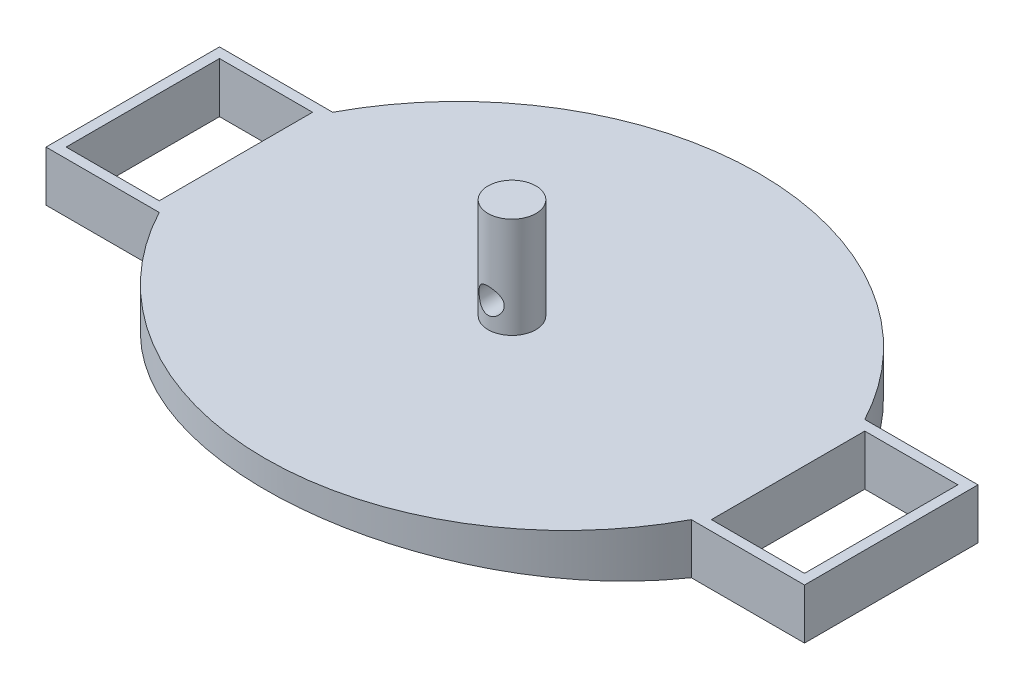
ISO-10303-21;
HEADER;
FILE_DESCRIPTION(('STEP AP214'),'2;1');
FILE_NAME('part.step','',(''),(''),'','','');
FILE_SCHEMA(('AUTOMOTIVE_DESIGN { 1 0 10303 214 1 1 1 1 }'));
ENDSEC;
DATA;
#1=APPLICATION_CONTEXT('core data for automotive mechanical design processes');
#2=APPLICATION_PROTOCOL_DEFINITION('international standard','automotive_design',2000,#1);
#3=PRODUCT_CONTEXT('',#1,'mechanical');
#4=PRODUCT('Part','Part','',(#3));
#5=PRODUCT_RELATED_PRODUCT_CATEGORY('part','',(#4));
#6=PRODUCT_DEFINITION_FORMATION('','',#4);
#7=PRODUCT_DEFINITION_CONTEXT('part definition',#1,'design');
#8=PRODUCT_DEFINITION('design','',#6,#7);
#9=PRODUCT_DEFINITION_SHAPE('','',#8);
#10=(LENGTH_UNIT() NAMED_UNIT(*) SI_UNIT(.MILLI.,.METRE.));
#11=(NAMED_UNIT(*) PLANE_ANGLE_UNIT() SI_UNIT($,.RADIAN.));
#12=(NAMED_UNIT(*) SI_UNIT($,.STERADIAN.) SOLID_ANGLE_UNIT());
#13=UNCERTAINTY_MEASURE_WITH_UNIT(LENGTH_MEASURE(1.E-05),#10,'distance_accuracy_value','');
#14=(GEOMETRIC_REPRESENTATION_CONTEXT(3) GLOBAL_UNCERTAINTY_ASSIGNED_CONTEXT((#13)) GLOBAL_UNIT_ASSIGNED_CONTEXT((#10,
#11,#12)) REPRESENTATION_CONTEXT('',''));
#15=CARTESIAN_POINT('',(0.,0.,0.));
#16=DIRECTION('',(0.,0.,1.));
#17=DIRECTION('',(1.,0.,0.));
#18=AXIS2_PLACEMENT_3D('',#15,#16,#17);
#19=CARTESIAN_POINT('',(0.,0.,55.6303340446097));
#20=DIRECTION('',(0.,-1.,0.));
#21=DIRECTION('',(0.,0.,-1.));
#22=AXIS2_PLACEMENT_3D('',#19,#20,#21);
#23=PLANE('',#22);
#24=DIRECTION('',(0.,0.,1.));
#25=VECTOR('',#24,1.);
#26=CARTESIAN_POINT('',(52.8406938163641,0.,-4.15939026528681));
#27=LINE('',#26,#25);
#28=CARTESIAN_POINT('',(52.8406938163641,0.,27.656191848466));
#29=VERTEX_POINT('',#28);
#30=CARTESIAN_POINT('',(52.8406938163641,0.,62.117160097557));
#31=VERTEX_POINT('',#30);
#32=EDGE_CURVE('E160',#29,#31,#27,.T.);
#33=ORIENTED_EDGE('',*,*,#32,.F.);
#34=DIRECTION('',(-1.,0.,0.));
#35=VECTOR('',#34,1.);
#36=CARTESIAN_POINT('',(52.8406938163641,0.,27.656191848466));
#37=LINE('',#36,#35);
#38=CARTESIAN_POINT('',(75.3294951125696,0.,27.656191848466));
#39=VERTEX_POINT('',#38);
#40=EDGE_CURVE('E203',#39,#29,#37,.T.);
#41=ORIENTED_EDGE('',*,*,#40,.F.);
#42=DIRECTION('',(0.,0.,-1.));
#43=VECTOR('',#42,1.);
#44=CARTESIAN_POINT('',(75.3294951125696,0.,62.1171600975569));
#45=LINE('',#44,#43);
#46=CARTESIAN_POINT('',(75.3294951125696,0.,62.1171600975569));
#47=VERTEX_POINT('',#46);
#48=EDGE_CURVE('E207',#47,#39,#45,.T.);
#49=ORIENTED_EDGE('',*,*,#48,.F.);
#50=DIRECTION('',(1.,0.,0.));
#51=VECTOR('',#50,1.);
#52=CARTESIAN_POINT('',(52.8406938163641,0.,62.1171600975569));
#53=LINE('',#52,#51);
#54=EDGE_CURVE('E209',#31,#47,#53,.T.);
#55=ORIENTED_EDGE('',*,*,#54,.F.);
#56=EDGE_LOOP('',(#33,#41,#49,#55));
#57=FACE_BOUND('',#56,.T.);
#58=DIRECTION('',(0.,0.,1.));
#59=VECTOR('',#58,1.);
#60=CARTESIAN_POINT('',(54.8406938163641,0.,60.1171600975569));
#61=LINE('',#60,#59);
#62=CARTESIAN_POINT('',(54.8406938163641,0.,29.656191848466));
#63=VERTEX_POINT('',#62);
#64=CARTESIAN_POINT('',(54.8406938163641,0.,60.1171600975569));
#65=VERTEX_POINT('',#64);
#66=EDGE_CURVE('E265',#63,#65,#61,.T.);
#67=ORIENTED_EDGE('',*,*,#66,.T.);
#68=DIRECTION('',(1.,0.,0.));
#69=VECTOR('',#68,1.);
#70=CARTESIAN_POINT('',(73.3294951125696,0.,60.1171600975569));
#71=LINE('',#70,#69);
#72=CARTESIAN_POINT('',(73.3294951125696,0.,60.1171600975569));
#73=VERTEX_POINT('',#72);
#74=EDGE_CURVE('E58',#65,#73,#71,.T.);
#75=ORIENTED_EDGE('',*,*,#74,.T.);
#76=DIRECTION('',(0.,0.,-1.));
#77=VECTOR('',#76,1.);
#78=CARTESIAN_POINT('',(73.3294951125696,0.,60.1171600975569));
#79=LINE('',#78,#77);
#80=CARTESIAN_POINT('',(73.3294951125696,0.,29.656191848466));
#81=VERTEX_POINT('',#80);
#82=EDGE_CURVE('E272',#73,#81,#79,.T.);
#83=ORIENTED_EDGE('',*,*,#82,.T.);
#84=DIRECTION('',(-1.,0.,0.));
#85=VECTOR('',#84,1.);
#86=CARTESIAN_POINT('',(73.3294951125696,0.,29.656191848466));
#87=LINE('',#86,#85);
#88=EDGE_CURVE('E269',#81,#63,#87,.T.);
#89=ORIENTED_EDGE('',*,*,#88,.T.);
#90=EDGE_LOOP('',(#67,#75,#83,#89));
#91=FACE_BOUND('',#90,.T.);
#92=ADVANCED_FACE('F35',(#57,#91),#23,.T.);
#93=CARTESIAN_POINT('',(0.,10.,55.6303340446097));
#94=DIRECTION('',(0.,-1.,0.));
#95=DIRECTION('',(0.,0.,-1.));
#96=AXIS2_PLACEMENT_3D('',#93,#94,#95);
#97=PLANE('',#96);
#98=CARTESIAN_POINT('',(0.,10.,44.8866759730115));
#99=DIRECTION('',(0.,-1.,0.));
#100=DIRECTION('',(0.,0.,-1.));
#101=AXIS2_PLACEMENT_3D('',#98,#99,#100);
#102=CIRCLE('',#101,4.75);
#103=CARTESIAN_POINT('',(0.,10.,40.1366759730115));
#104=VERTEX_POINT('',#103);
#105=EDGE_CURVE('E11',#104,#104,#102,.F.);
#106=ORIENTED_EDGE('',*,*,#105,.F.);
#107=EDGE_LOOP('',(#106));
#108=FACE_BOUND('',#107,.T.);
#109=DIRECTION('',(0.,0.,1.));
#110=VECTOR('',#109,1.);
#111=CARTESIAN_POINT('',(-73.3294951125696,10.,60.1171600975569));
#112=LINE('',#111,#110);
#113=CARTESIAN_POINT('',(-73.3294951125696,10.,29.656191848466));
#114=VERTEX_POINT('',#113);
#115=CARTESIAN_POINT('',(-73.3294951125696,10.,60.1171600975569));
#116=VERTEX_POINT('',#115);
#117=EDGE_CURVE('E240',#114,#116,#112,.T.);
#118=ORIENTED_EDGE('',*,*,#117,.F.);
#119=DIRECTION('',(-1.,0.,0.));
#120=VECTOR('',#119,1.);
#121=CARTESIAN_POINT('',(-73.3294951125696,10.,29.656191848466));
#122=LINE('',#121,#120);
#123=CARTESIAN_POINT('',(-54.8406938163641,10.,29.656191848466));
#124=VERTEX_POINT('',#123);
#125=EDGE_CURVE('E236',#124,#114,#122,.T.);
#126=ORIENTED_EDGE('',*,*,#125,.F.);
#127=DIRECTION('',(0.,0.,-1.));
#128=VECTOR('',#127,1.);
#129=CARTESIAN_POINT('',(-54.8406938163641,10.,60.1171600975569));
#130=LINE('',#129,#128);
#131=CARTESIAN_POINT('',(-54.8406938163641,10.,60.1171600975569));
#132=VERTEX_POINT('',#131);
#133=EDGE_CURVE('E252',#132,#124,#130,.T.);
#134=ORIENTED_EDGE('',*,*,#133,.F.);
#135=DIRECTION('',(1.,0.,0.));
#136=VECTOR('',#135,1.);
#137=CARTESIAN_POINT('',(-73.3294951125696,10.,60.1171600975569));
#138=LINE('',#137,#136);
#139=EDGE_CURVE('E255',#116,#132,#138,.T.);
#140=ORIENTED_EDGE('',*,*,#139,.F.);
#141=EDGE_LOOP('',(#118,#126,#134,#140));
#142=FACE_BOUND('',#141,.T.);
#143=CARTESIAN_POINT('',(0.,10.,55.6303340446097));
#144=DIRECTION('',(0.,1.,0.));
#145=DIRECTION('',(0.,0.,-1.));
#146=AXIS2_PLACEMENT_3D('',#143,#144,#145);
#147=CIRCLE('',#146,59.7887243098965);
#148=CARTESIAN_POINT('',(52.8406938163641,10.,27.656191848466));
#149=VERTEX_POINT('',#148);
#150=CARTESIAN_POINT('',(-52.8406938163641,10.,27.656191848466));
#151=VERTEX_POINT('',#150);
#152=EDGE_CURVE('E206',#149,#151,#147,.T.);
#153=ORIENTED_EDGE('',*,*,#152,.T.);
#154=DIRECTION('',(-1.,0.,0.));
#155=VECTOR('',#154,1.);
#156=CARTESIAN_POINT('',(-52.8406938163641,10.,27.656191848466));
#157=LINE('',#156,#155);
#158=CARTESIAN_POINT('',(-75.3294951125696,10.,27.656191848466));
#159=VERTEX_POINT('',#158);
#160=EDGE_CURVE('E181',#151,#159,#157,.T.);
#161=ORIENTED_EDGE('',*,*,#160,.T.);
#162=DIRECTION('',(0.,0.,1.));
#163=VECTOR('',#162,1.);
#164=CARTESIAN_POINT('',(-75.3294951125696,10.,62.1171600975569));
#165=LINE('',#164,#163);
#166=CARTESIAN_POINT('',(-75.3294951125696,10.,62.1171600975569));
#167=VERTEX_POINT('',#166);
#168=EDGE_CURVE('E223',#159,#167,#165,.T.);
#169=ORIENTED_EDGE('',*,*,#168,.T.);
#170=DIRECTION('',(1.,0.,0.));
#171=VECTOR('',#170,1.);
#172=CARTESIAN_POINT('',(-52.8406938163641,10.,62.1171600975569));
#173=LINE('',#172,#171);
#174=CARTESIAN_POINT('',(-52.8406938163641,10.,62.1171600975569));
#175=VERTEX_POINT('',#174);
#176=EDGE_CURVE('E221',#167,#175,#173,.T.);
#177=ORIENTED_EDGE('',*,*,#176,.T.);
#178=CARTESIAN_POINT('',(0.,10.,34.1430179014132));
#179=DIRECTION('',(0.,1.,0.));
#180=DIRECTION('',(0.,0.,1.));
#181=AXIS2_PLACEMENT_3D('',#178,#179,#180);
#182=CIRCLE('',#181,59.7887243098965);
#183=CARTESIAN_POINT('',(52.8406938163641,10.,62.117160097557));
#184=VERTEX_POINT('',#183);
#185=EDGE_CURVE('E219',#175,#184,#182,.T.);
#186=ORIENTED_EDGE('',*,*,#185,.T.);
#187=DIRECTION('',(1.,0.,0.));
#188=VECTOR('',#187,1.);
#189=CARTESIAN_POINT('',(52.8406938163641,10.,62.1171600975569));
#190=LINE('',#189,#188);
#191=CARTESIAN_POINT('',(75.3294951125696,10.,62.1171600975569));
#192=VERTEX_POINT('',#191);
#193=EDGE_CURVE('E217',#184,#192,#190,.T.);
#194=ORIENTED_EDGE('',*,*,#193,.T.);
#195=DIRECTION('',(0.,0.,-1.));
#196=VECTOR('',#195,1.);
#197=CARTESIAN_POINT('',(75.3294951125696,10.,62.1171600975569));
#198=LINE('',#197,#196);
#199=CARTESIAN_POINT('',(75.3294951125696,10.,27.656191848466));
#200=VERTEX_POINT('',#199);
#201=EDGE_CURVE('E215',#192,#200,#198,.T.);
#202=ORIENTED_EDGE('',*,*,#201,.T.);
#203=DIRECTION('',(-1.,0.,0.));
#204=VECTOR('',#203,1.);
#205=CARTESIAN_POINT('',(52.8406938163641,10.,27.656191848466));
#206=LINE('',#205,#204);
#207=EDGE_CURVE('E202',#200,#149,#206,.T.);
#208=ORIENTED_EDGE('',*,*,#207,.T.);
#209=EDGE_LOOP('',(#153,#161,#169,#177,#186,#194,#202,#208));
#210=FACE_BOUND('',#209,.T.);
#211=DIRECTION('',(1.,0.,0.));
#212=VECTOR('',#211,1.);
#213=CARTESIAN_POINT('',(73.3294951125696,10.,60.1171600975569));
#214=LINE('',#213,#212);
#215=CARTESIAN_POINT('',(54.8406938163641,10.,60.1171600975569));
#216=VERTEX_POINT('',#215);
#217=CARTESIAN_POINT('',(73.3294951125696,10.,60.1171600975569));
#218=VERTEX_POINT('',#217);
#219=EDGE_CURVE('E268',#216,#218,#214,.T.);
#220=ORIENTED_EDGE('',*,*,#219,.F.);
#221=DIRECTION('',(0.,0.,1.));
#222=VECTOR('',#221,1.);
#223=CARTESIAN_POINT('',(54.8406938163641,10.,60.1171600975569));
#224=LINE('',#223,#222);
#225=CARTESIAN_POINT('',(54.8406938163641,10.,29.656191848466));
#226=VERTEX_POINT('',#225);
#227=EDGE_CURVE('E264',#226,#216,#224,.T.);
#228=ORIENTED_EDGE('',*,*,#227,.F.);
#229=DIRECTION('',(-1.,0.,0.));
#230=VECTOR('',#229,1.);
#231=CARTESIAN_POINT('',(73.3294951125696,10.,29.656191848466));
#232=LINE('',#231,#230);
#233=CARTESIAN_POINT('',(73.3294951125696,10.,29.656191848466));
#234=VERTEX_POINT('',#233);
#235=EDGE_CURVE('E278',#234,#226,#232,.T.);
#236=ORIENTED_EDGE('',*,*,#235,.F.);
#237=DIRECTION('',(0.,0.,-1.));
#238=VECTOR('',#237,1.);
#239=CARTESIAN_POINT('',(73.3294951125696,10.,60.1171600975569));
#240=LINE('',#239,#238);
#241=EDGE_CURVE('E280',#218,#234,#240,.T.);
#242=ORIENTED_EDGE('',*,*,#241,.F.);
#243=EDGE_LOOP('',(#220,#228,#236,#242));
#244=FACE_BOUND('',#243,.T.);
#245=ADVANCED_FACE('F336',(#108,#142,#210,#244),#97,.F.);
#246=DIRECTION('',(0.,0.,1.));
#247=VECTOR('',#246,1.);
#248=CARTESIAN_POINT('',(-52.8406938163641,0.,-4.15939026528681));
#249=LINE('',#248,#247);
#250=CARTESIAN_POINT('',(-52.8406938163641,0.,27.656191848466));
#251=VERTEX_POINT('',#250);
#252=CARTESIAN_POINT('',(-52.8406938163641,0.,62.1171600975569));
#253=VERTEX_POINT('',#252);
#254=EDGE_CURVE('E149',#251,#253,#249,.T.);
#255=ORIENTED_EDGE('',*,*,#254,.T.);
#256=DIRECTION('',(1.,0.,0.));
#257=VECTOR('',#256,1.);
#258=CARTESIAN_POINT('',(-52.8406938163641,0.,62.1171600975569));
#259=LINE('',#258,#257);
#260=CARTESIAN_POINT('',(-75.3294951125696,0.,62.1171600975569));
#261=VERTEX_POINT('',#260);
#262=EDGE_CURVE('E211',#261,#253,#259,.T.);
#263=ORIENTED_EDGE('',*,*,#262,.F.);
#264=DIRECTION('',(0.,0.,1.));
#265=VECTOR('',#264,1.);
#266=CARTESIAN_POINT('',(-75.3294951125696,0.,62.1171600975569));
#267=LINE('',#266,#265);
#268=CARTESIAN_POINT('',(-75.3294951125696,0.,27.656191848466));
#269=VERTEX_POINT('',#268);
#270=EDGE_CURVE('E174',#269,#261,#267,.T.);
#271=ORIENTED_EDGE('',*,*,#270,.F.);
#272=DIRECTION('',(-1.,0.,0.));
#273=VECTOR('',#272,1.);
#274=CARTESIAN_POINT('',(-52.8406938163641,0.,27.656191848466));
#275=LINE('',#274,#273);
#276=EDGE_CURVE('E171',#251,#269,#275,.T.);
#277=ORIENTED_EDGE('',*,*,#276,.F.);
#278=EDGE_LOOP('',(#255,#263,#271,#277));
#279=FACE_BOUND('',#278,.T.);
#280=DIRECTION('',(-1.,0.,0.));
#281=VECTOR('',#280,1.);
#282=CARTESIAN_POINT('',(-73.3294951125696,0.,29.656191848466));
#283=LINE('',#282,#281);
#284=CARTESIAN_POINT('',(-54.8406938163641,0.,29.656191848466));
#285=VERTEX_POINT('',#284);
#286=CARTESIAN_POINT('',(-73.3294951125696,0.,29.656191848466));
#287=VERTEX_POINT('',#286);
#288=EDGE_CURVE('E237',#285,#287,#283,.T.);
#289=ORIENTED_EDGE('',*,*,#288,.T.);
#290=DIRECTION('',(0.,0.,1.));
#291=VECTOR('',#290,1.);
#292=CARTESIAN_POINT('',(-73.3294951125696,0.,60.1171600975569));
#293=LINE('',#292,#291);
#294=CARTESIAN_POINT('',(-73.3294951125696,0.,60.1171600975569));
#295=VERTEX_POINT('',#294);
#296=EDGE_CURVE('E247',#287,#295,#293,.T.);
#297=ORIENTED_EDGE('',*,*,#296,.T.);
#298=DIRECTION('',(1.,0.,0.));
#299=VECTOR('',#298,1.);
#300=CARTESIAN_POINT('',(-73.3294951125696,0.,60.1171600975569));
#301=LINE('',#300,#299);
#302=CARTESIAN_POINT('',(-54.8406938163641,0.,60.1171600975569));
#303=VERTEX_POINT('',#302);
#304=EDGE_CURVE('E244',#295,#303,#301,.T.);
#305=ORIENTED_EDGE('',*,*,#304,.T.);
#306=DIRECTION('',(0.,0.,-1.));
#307=VECTOR('',#306,1.);
#308=CARTESIAN_POINT('',(-54.8406938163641,0.,60.1171600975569));
#309=LINE('',#308,#307);
#310=EDGE_CURVE('E241',#303,#285,#309,.T.);
#311=ORIENTED_EDGE('',*,*,#310,.T.);
#312=EDGE_LOOP('',(#289,#297,#305,#311));
#313=FACE_BOUND('',#312,.T.);
#314=ADVANCED_FACE('F172',(#279,#313),#23,.T.);
#315=CARTESIAN_POINT('',(0.,10.,55.6303340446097));
#316=DIRECTION('',(0.,-1.,0.));
#317=DIRECTION('',(0.,0.,-1.));
#318=AXIS2_PLACEMENT_3D('',#315,#316,#317);
#319=CYLINDRICAL_SURFACE('',#318,59.7887243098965);
#320=DIRECTION('',(0.,-1.,0.));
#321=VECTOR('',#320,1.);
#322=CARTESIAN_POINT('',(52.8406938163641,10.,27.656191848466));
#323=LINE('',#322,#321);
#324=EDGE_CURVE('E168',#149,#29,#323,.T.);
#325=ORIENTED_EDGE('',*,*,#324,.T.);
#326=CARTESIAN_POINT('',(-52.8406938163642,0.,27.6561918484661));
#327=CARTESIAN_POINT('',(-52.4455885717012,0.0699177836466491,26.9098531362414));
#328=CARTESIAN_POINT('',(-52.034737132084,0.141818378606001,26.1720492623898));
#329=CARTESIAN_POINT('',(-51.1823306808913,0.289043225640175,24.7147575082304));
#330=CARTESIAN_POINT('',(-50.7407760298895,0.364367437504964,23.9952694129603));
#331=CARTESIAN_POINT('',(-49.827780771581,0.517892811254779,22.575897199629));
#332=CARTESIAN_POINT('',(-49.3563426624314,0.596093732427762,21.8760114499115));
#333=CARTESIAN_POINT('',(-48.3844432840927,0.754805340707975,20.4970308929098));
#334=CARTESIAN_POINT('',(-47.8839819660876,0.83531603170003,19.8179361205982));
#335=CARTESIAN_POINT('',(-46.3407668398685,1.07938563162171,17.814129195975));
#336=CARTESIAN_POINT('',(-45.2556010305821,1.24558082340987,16.5219918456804));
#337=CARTESIAN_POINT('',(-42.9803057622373,1.58017959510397,14.034333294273));
#338=CARTESIAN_POINT('',(-41.7901760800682,1.74858317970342,12.8388122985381));
#339=CARTESIAN_POINT('',(-39.3125237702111,2.08292472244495,10.5519616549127));
#340=CARTESIAN_POINT('',(-38.0249675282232,2.24886180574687,9.46066826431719));
#341=CARTESIAN_POINT('',(-35.361654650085,2.5735278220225,7.39041395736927));
#342=CARTESIAN_POINT('',(-33.98589756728,2.73225671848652,6.41145360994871));
#343=CARTESIAN_POINT('',(-31.1559408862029,3.03799620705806,4.5730602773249));
#344=CARTESIAN_POINT('',(-29.7017604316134,3.18500963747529,3.7135983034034));
#345=CARTESIAN_POINT('',(-26.7247151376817,3.46320530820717,2.12022750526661));
#346=CARTESIAN_POINT('',(-25.2018508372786,3.59438767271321,1.38631769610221));
#347=CARTESIAN_POINT('',(-22.1024173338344,3.83686008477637,0.0514363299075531));
#348=CARTESIAN_POINT('',(-20.5260085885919,3.94820423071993,-0.549897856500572));
#349=CARTESIAN_POINT('',(-17.3266986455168,4.14828007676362,-1.61755567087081));
#350=CARTESIAN_POINT('',(-15.7037974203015,4.23701176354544,-2.08387921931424));
#351=CARTESIAN_POINT('',(-12.4231704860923,4.38932673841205,-2.87782530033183));
#352=CARTESIAN_POINT('',(-10.7654432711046,4.45290893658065,-3.20544182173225));
#353=CARTESIAN_POINT('',(-7.42741761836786,4.55308824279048,-3.71927848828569));
#354=CARTESIAN_POINT('',(-5.74711950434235,4.58968573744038,-3.90550065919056));
#355=CARTESIAN_POINT('',(-2.40514191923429,4.6344561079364,-4.13306710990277));
#356=CARTESIAN_POINT('',(-0.743632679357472,4.64310243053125,-4.17682459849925));
#357=CARTESIAN_POINT('',(2.57716793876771,4.63306216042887,-4.12589789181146));
#358=CARTESIAN_POINT('',(4.23645934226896,4.61437588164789,-4.03121528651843));
#359=CARTESIAN_POINT('',(7.54069151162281,4.55019690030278,-3.7041877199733));
#360=CARTESIAN_POINT('',(9.18563393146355,4.50470732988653,-3.47185884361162));
#361=CARTESIAN_POINT('',(12.4496131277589,4.3881927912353,-2.87139435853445));
#362=CARTESIAN_POINT('',(14.0686499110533,4.31716782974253,-2.50325878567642));
#363=CARTESIAN_POINT('',(17.2607271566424,4.15200242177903,-1.63640427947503));
#364=CARTESIAN_POINT('',(18.8339689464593,4.05798900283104,-1.13840197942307));
#365=CARTESIAN_POINT('',(21.9327104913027,3.84921885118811,-0.0146482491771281));
#366=CARTESIAN_POINT('',(23.4582102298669,3.73446211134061,0.611103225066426));
#367=CARTESIAN_POINT('',(26.4516365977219,3.48727794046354,1.98598583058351));
#368=CARTESIAN_POINT('',(27.919544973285,3.35484496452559,2.73515569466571));
#369=CARTESIAN_POINT('',(30.7875099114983,3.07591005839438,4.35138928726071));
#370=CARTESIAN_POINT('',(32.1875671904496,2.92940827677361,5.21845177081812));
#371=CARTESIAN_POINT('',(34.9307447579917,2.62403263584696,7.0780864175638));
#372=CARTESIAN_POINT('',(36.2727228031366,2.46500834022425,8.07231899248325));
#373=CARTESIAN_POINT('',(38.8685484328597,2.14088742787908,10.1692350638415));
#374=CARTESIAN_POINT('',(40.1223865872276,1.97579016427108,11.2719301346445));
#375=CARTESIAN_POINT('',(42.5322268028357,1.64425723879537,13.5770425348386));
#376=CARTESIAN_POINT('',(43.6883188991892,1.47782296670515,14.7793660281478));
#377=CARTESIAN_POINT('',(45.8959487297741,1.14810248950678,17.276345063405));
#378=CARTESIAN_POINT('',(46.9475260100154,0.98481511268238,18.5709653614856));
#379=CARTESIAN_POINT('',(48.4002956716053,0.752195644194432,20.5206648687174));
#380=CARTESIAN_POINT('',(48.8456364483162,0.679813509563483,21.1429294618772));
#381=CARTESIAN_POINT('',(49.7121405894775,0.537098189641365,22.4041446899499));
#382=CARTESIAN_POINT('',(50.1333095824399,0.466764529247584,23.0430913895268));
#383=CARTESIAN_POINT('',(50.9501963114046,0.328675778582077,24.3357243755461));
#384=CARTESIAN_POINT('',(51.345957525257,0.260916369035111,24.9893827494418));
#385=CARTESIAN_POINT('',(52.1123492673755,0.128229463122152,26.31175753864));
#386=CARTESIAN_POINT('',(52.4829738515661,0.0633026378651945,26.9804774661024));
#387=CARTESIAN_POINT('',(52.8406938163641,0.,27.656191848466));
#388=B_SPLINE_CURVE_WITH_KNOTS('',3,(#326,#327,#328,#329,#330,#331,#332,#333,#334,#335,#336,
#337,#338,#339,#340,#341,#342,#343,#344,#345,#346,#347,#348,#349,#350,#351,#352,#353,#354,#355,
#356,#357,#358,#359,#360,#361,#362,#363,#364,#365,#366,#367,#368,#369,#370,#371,#372,#373,#374,
#375,#376,#377,#378,#379,#380,#381,#382,#383,#384,#385,#386,#387),.UNSPECIFIED.,.F.,.F.,(4,2,2,
2,2,2,2,2,2,2,2,2,2,2,2,2,2,2,2,2,2,2,2,2,2,2,2,2,2,2,4),(0.,2.54186674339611,5.08370364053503,
7.6253283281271,10.1669572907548,15.2469919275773,20.3270373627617,25.4088435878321,
30.4906755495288,35.571272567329,40.651829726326,45.7183128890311,50.784799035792,
55.8515047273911,60.918137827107,65.8984881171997,70.8787812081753,75.8584924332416,
80.8382023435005,85.7909941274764,90.7437876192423,95.6981384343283,100.65243693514,
105.679701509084,110.707503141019,115.730621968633,120.751832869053,123.057257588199,
125.362143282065,127.662973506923,129.964345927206),.UNSPECIFIED.);
#389=EDGE_CURVE('E152',#251,#29,#388,.T.);
#390=ORIENTED_EDGE('',*,*,#389,.F.);
#391=DIRECTION('',(0.,-1.,0.));
#392=VECTOR('',#391,1.);
#393=CARTESIAN_POINT('',(-52.8406938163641,10.,27.656191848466));
#394=LINE('',#393,#392);
#395=EDGE_CURVE('E43',#151,#251,#394,.T.);
#396=ORIENTED_EDGE('',*,*,#395,.F.);
#397=ORIENTED_EDGE('',*,*,#152,.F.);
#398=EDGE_LOOP('',(#325,#390,#396,#397));
#399=FACE_BOUND('',#398,.T.);
#400=ADVANCED_FACE('F37',(#399),#319,.T.);
#401=CARTESIAN_POINT('',(-52.8406938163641,10.,27.656191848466));
#402=DIRECTION('',(0.,0.,1.));
#403=DIRECTION('',(1.,0.,0.));
#404=AXIS2_PLACEMENT_3D('',#401,#402,#403);
#405=PLANE('',#404);
#406=ORIENTED_EDGE('',*,*,#276,.T.);
#407=DIRECTION('',(0.,-1.,0.));
#408=VECTOR('',#407,1.);
#409=CARTESIAN_POINT('',(-75.3294951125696,10.,27.656191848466));
#410=LINE('',#409,#408);
#411=EDGE_CURVE('E183',#159,#269,#410,.T.);
#412=ORIENTED_EDGE('',*,*,#411,.F.);
#413=ORIENTED_EDGE('',*,*,#160,.F.);
#414=ORIENTED_EDGE('',*,*,#395,.T.);
#415=EDGE_LOOP('',(#406,#412,#413,#414));
#416=FACE_BOUND('',#415,.T.);
#417=ADVANCED_FACE('F180',(#416),#405,.F.);
#418=CARTESIAN_POINT('',(-75.3294951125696,10.,62.1171600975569));
#419=DIRECTION('',(1.,0.,0.));
#420=DIRECTION('',(0.,0.,-1.));
#421=AXIS2_PLACEMENT_3D('',#418,#419,#420);
#422=PLANE('',#421);
#423=ORIENTED_EDGE('',*,*,#270,.T.);
#424=DIRECTION('',(0.,-1.,0.));
#425=VECTOR('',#424,1.);
#426=CARTESIAN_POINT('',(-75.3294951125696,10.,62.1171600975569));
#427=LINE('',#426,#425);
#428=EDGE_CURVE('E184',#167,#261,#427,.T.);
#429=ORIENTED_EDGE('',*,*,#428,.F.);
#430=ORIENTED_EDGE('',*,*,#168,.F.);
#431=ORIENTED_EDGE('',*,*,#411,.T.);
#432=EDGE_LOOP('',(#423,#429,#430,#431));
#433=FACE_BOUND('',#432,.T.);
#434=ADVANCED_FACE('F377',(#433),#422,.F.);
#435=CARTESIAN_POINT('',(-52.8406938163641,10.,62.1171600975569));
#436=DIRECTION('',(0.,0.,-1.));
#437=DIRECTION('',(-1.,0.,0.));
#438=AXIS2_PLACEMENT_3D('',#435,#436,#437);
#439=PLANE('',#438);
#440=ORIENTED_EDGE('',*,*,#262,.T.);
#441=DIRECTION('',(0.,-1.,0.));
#442=VECTOR('',#441,1.);
#443=CARTESIAN_POINT('',(-52.8406938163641,10.,62.1171600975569));
#444=LINE('',#443,#442);
#445=EDGE_CURVE('E189',#175,#253,#444,.T.);
#446=ORIENTED_EDGE('',*,*,#445,.F.);
#447=ORIENTED_EDGE('',*,*,#176,.F.);
#448=ORIENTED_EDGE('',*,*,#428,.T.);
#449=EDGE_LOOP('',(#440,#446,#447,#448));
#450=FACE_BOUND('',#449,.T.);
#451=ADVANCED_FACE('F381',(#450),#439,.F.);
#452=CARTESIAN_POINT('',(0.,10.,34.1430179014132));
#453=DIRECTION('',(0.,-1.,0.));
#454=DIRECTION('',(0.,0.,-1.));
#455=AXIS2_PLACEMENT_3D('',#452,#453,#454);
#456=CYLINDRICAL_SURFACE('',#455,59.7887243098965);
#457=ORIENTED_EDGE('',*,*,#445,.T.);
#458=CARTESIAN_POINT('',(52.8406938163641,0.,62.117160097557));
#459=CARTESIAN_POINT('',(52.4455885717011,0.0699177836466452,62.8634988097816));
#460=CARTESIAN_POINT('',(52.034737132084,0.141818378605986,63.6013026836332));
#461=CARTESIAN_POINT('',(51.1823306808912,0.289043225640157,65.0585944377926));
#462=CARTESIAN_POINT('',(50.7407760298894,0.364367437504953,65.7780825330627));
#463=CARTESIAN_POINT('',(49.8277807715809,0.517892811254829,67.197454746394));
#464=CARTESIAN_POINT('',(49.3563426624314,0.596093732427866,67.8973404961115));
#465=CARTESIAN_POINT('',(48.3844432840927,0.754805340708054,69.2763210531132));
#466=CARTESIAN_POINT('',(47.8839819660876,0.835316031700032,69.9554158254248));
#467=CARTESIAN_POINT('',(46.3407668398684,1.07938563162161,71.959222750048));
#468=CARTESIAN_POINT('',(45.255601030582,1.24558082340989,73.2513601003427));
#469=CARTESIAN_POINT('',(42.9803057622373,1.58017959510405,75.7390186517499));
#470=CARTESIAN_POINT('',(41.7901760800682,1.74858317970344,76.9345396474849));
#471=CARTESIAN_POINT('',(39.312523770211,2.08292472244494,79.2213902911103));
#472=CARTESIAN_POINT('',(38.0249675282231,2.24886180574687,80.3126836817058));
#473=CARTESIAN_POINT('',(35.3616546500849,2.57352782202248,82.3829379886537));
#474=CARTESIAN_POINT('',(33.9858975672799,2.73225671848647,83.3618983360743));
#475=CARTESIAN_POINT('',(31.1559408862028,3.03799620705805,85.2002916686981));
#476=CARTESIAN_POINT('',(29.7017604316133,3.18500963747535,86.0597536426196));
#477=CARTESIAN_POINT('',(26.7247151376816,3.46320530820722,87.6531244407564));
#478=CARTESIAN_POINT('',(25.2018508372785,3.59438767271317,88.3870342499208));
#479=CARTESIAN_POINT('',(22.1024173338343,3.83686008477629,89.7219156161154));
#480=CARTESIAN_POINT('',(20.5260085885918,3.9482042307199,90.3232498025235));
#481=CARTESIAN_POINT('',(17.3266986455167,4.14828007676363,91.3909076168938));
#482=CARTESIAN_POINT('',(15.7037974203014,4.23701176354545,91.8572311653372));
#483=CARTESIAN_POINT('',(12.4231704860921,4.38932673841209,92.6511772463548));
#484=CARTESIAN_POINT('',(10.7654432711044,4.45290893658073,92.9787937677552));
#485=CARTESIAN_POINT('',(7.42741761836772,4.55308824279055,93.4926304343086));
#486=CARTESIAN_POINT('',(5.74711950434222,4.5896857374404,93.6788526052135));
#487=CARTESIAN_POINT('',(2.40514191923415,4.63445610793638,93.9064190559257));
#488=CARTESIAN_POINT('',(0.743632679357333,4.64310243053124,93.9501765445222));
#489=CARTESIAN_POINT('',(-2.57716793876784,4.63306216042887,93.8992498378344));
#490=CARTESIAN_POINT('',(-4.23645934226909,4.6143758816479,93.8045672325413));
#491=CARTESIAN_POINT('',(-7.54069151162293,4.55019690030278,93.4775396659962));
#492=CARTESIAN_POINT('',(-9.18563393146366,4.50470732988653,93.2452107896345));
#493=CARTESIAN_POINT('',(-12.449613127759,4.3881927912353,92.6447463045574));
#494=CARTESIAN_POINT('',(-14.0686499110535,4.31716782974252,92.2766107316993));
#495=CARTESIAN_POINT('',(-17.2607271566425,4.15200242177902,91.4097562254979));
#496=CARTESIAN_POINT('',(-18.8339689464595,4.05798900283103,90.911753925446));
#497=CARTESIAN_POINT('',(-21.9327104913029,3.84921885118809,89.7880001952));
#498=CARTESIAN_POINT('',(-23.458210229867,3.73446211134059,89.1622487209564));
#499=CARTESIAN_POINT('',(-26.451636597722,3.48727794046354,87.7873661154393));
#500=CARTESIAN_POINT('',(-27.9195449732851,3.35484496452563,87.0381962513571));
#501=CARTESIAN_POINT('',(-30.7875099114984,3.07591005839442,85.4219626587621));
#502=CARTESIAN_POINT('',(-32.1875671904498,2.92940827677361,84.5549001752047));
#503=CARTESIAN_POINT('',(-34.9307447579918,2.62403263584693,82.695265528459));
#504=CARTESIAN_POINT('',(-36.2727228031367,2.46500834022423,81.7010329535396));
#505=CARTESIAN_POINT('',(-38.8685484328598,2.14088742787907,79.6041168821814));
#506=CARTESIAN_POINT('',(-40.1223865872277,1.97579016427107,78.5014218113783));
#507=CARTESIAN_POINT('',(-42.5322268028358,1.64425723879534,76.1963094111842));
#508=CARTESIAN_POINT('',(-43.6883188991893,1.47782296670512,74.993985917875));
#509=CARTESIAN_POINT('',(-45.8959487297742,1.14810248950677,72.4970068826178));
#510=CARTESIAN_POINT('',(-46.9475260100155,0.984815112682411,71.2023865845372));
#511=CARTESIAN_POINT('',(-48.4002956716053,0.752195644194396,69.2526870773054));
#512=CARTESIAN_POINT('',(-48.8456364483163,0.679813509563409,68.6304224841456));
#513=CARTESIAN_POINT('',(-49.7121405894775,0.5370981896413,67.3692072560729));
#514=CARTESIAN_POINT('',(-50.1333095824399,0.466764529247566,66.7302605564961));
#515=CARTESIAN_POINT('',(-50.9501963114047,0.328675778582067,65.4376275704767));
#516=CARTESIAN_POINT('',(-51.345957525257,0.260916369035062,64.783969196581));
#517=CARTESIAN_POINT('',(-52.1123492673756,0.128229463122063,63.4615944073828));
#518=CARTESIAN_POINT('',(-52.4829738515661,0.0633026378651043,62.7928744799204));
#519=CARTESIAN_POINT('',(-52.8406938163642,0.,62.1171600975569));
#520=B_SPLINE_CURVE_WITH_KNOTS('',3,(#458,#459,#460,#461,#462,#463,#464,#465,#466,#467,#468,
#469,#470,#471,#472,#473,#474,#475,#476,#477,#478,#479,#480,#481,#482,#483,#484,#485,#486,#487,
#488,#489,#490,#491,#492,#493,#494,#495,#496,#497,#498,#499,#500,#501,#502,#503,#504,#505,#506,
#507,#508,#509,#510,#511,#512,#513,#514,#515,#516,#517,#518,#519),.UNSPECIFIED.,.F.,.F.,(4,2,2,
2,2,2,2,2,2,2,2,2,2,2,2,2,2,2,2,2,2,2,2,2,2,2,2,2,2,2,4),(0.,2.5418667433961,5.08370364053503,
7.6253283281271,10.1669572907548,15.2469919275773,20.3270373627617,25.4088435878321,
30.4906755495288,35.571272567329,40.651829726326,45.7183128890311,50.784799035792,
55.8515047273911,60.9181378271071,65.8984881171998,70.8787812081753,75.8584924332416,
80.8382023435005,85.7909941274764,90.7437876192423,95.6981384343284,100.65243693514,
105.679701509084,110.707503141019,115.730621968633,120.751832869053,123.057257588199,
125.362143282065,127.662973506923,129.964345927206),.UNSPECIFIED.);
#521=EDGE_CURVE('E155',#31,#253,#520,.T.);
#522=ORIENTED_EDGE('',*,*,#521,.F.);
#523=DIRECTION('',(0.,-1.,0.));
#524=VECTOR('',#523,1.);
#525=CARTESIAN_POINT('',(52.8406938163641,10.,62.117160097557));
#526=LINE('',#525,#524);
#527=EDGE_CURVE('E192',#184,#31,#526,.T.);
#528=ORIENTED_EDGE('',*,*,#527,.F.);
#529=ORIENTED_EDGE('',*,*,#185,.F.);
#530=EDGE_LOOP('',(#457,#522,#528,#529));
#531=FACE_BOUND('',#530,.T.);
#532=ADVANCED_FACE('F387',(#531),#456,.T.);
#533=CARTESIAN_POINT('',(52.8406938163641,10.,62.1171600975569));
#534=DIRECTION('',(0.,0.,-1.));
#535=DIRECTION('',(-1.,0.,0.));
#536=AXIS2_PLACEMENT_3D('',#533,#534,#535);
#537=PLANE('',#536);
#538=ORIENTED_EDGE('',*,*,#54,.T.);
#539=DIRECTION('',(0.,-1.,0.));
#540=VECTOR('',#539,1.);
#541=CARTESIAN_POINT('',(75.3294951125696,10.,62.1171600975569));
#542=LINE('',#541,#540);
#543=EDGE_CURVE('E195',#192,#47,#542,.T.);
#544=ORIENTED_EDGE('',*,*,#543,.F.);
#545=ORIENTED_EDGE('',*,*,#193,.F.);
#546=ORIENTED_EDGE('',*,*,#527,.T.);
#547=EDGE_LOOP('',(#538,#544,#545,#546));
#548=FACE_BOUND('',#547,.T.);
#549=ADVANCED_FACE('F391',(#548),#537,.F.);
#550=CARTESIAN_POINT('',(75.3294951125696,10.,62.1171600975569));
#551=DIRECTION('',(-1.,0.,0.));
#552=DIRECTION('',(0.,0.,1.));
#553=AXIS2_PLACEMENT_3D('',#550,#551,#552);
#554=PLANE('',#553);
#555=ORIENTED_EDGE('',*,*,#48,.T.);
#556=DIRECTION('',(0.,-1.,0.));
#557=VECTOR('',#556,1.);
#558=CARTESIAN_POINT('',(75.3294951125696,10.,27.656191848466));
#559=LINE('',#558,#557);
#560=EDGE_CURVE('E198',#200,#39,#559,.T.);
#561=ORIENTED_EDGE('',*,*,#560,.F.);
#562=ORIENTED_EDGE('',*,*,#201,.F.);
#563=ORIENTED_EDGE('',*,*,#543,.T.);
#564=EDGE_LOOP('',(#555,#561,#562,#563));
#565=FACE_BOUND('',#564,.T.);
#566=ADVANCED_FACE('F395',(#565),#554,.F.);
#567=CARTESIAN_POINT('',(52.8406938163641,10.,27.656191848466));
#568=DIRECTION('',(0.,0.,1.));
#569=DIRECTION('',(1.,0.,0.));
#570=AXIS2_PLACEMENT_3D('',#567,#568,#569);
#571=PLANE('',#570);
#572=ORIENTED_EDGE('',*,*,#40,.T.);
#573=ORIENTED_EDGE('',*,*,#324,.F.);
#574=ORIENTED_EDGE('',*,*,#207,.F.);
#575=ORIENTED_EDGE('',*,*,#560,.T.);
#576=EDGE_LOOP('',(#572,#573,#574,#575));
#577=FACE_BOUND('',#576,.T.);
#578=ADVANCED_FACE('F398',(#577),#571,.F.);
#579=CARTESIAN_POINT('',(-73.3294951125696,10.,60.1171600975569));
#580=DIRECTION('',(1.,0.,0.));
#581=DIRECTION('',(0.,0.,-1.));
#582=AXIS2_PLACEMENT_3D('',#579,#580,#581);
#583=PLANE('',#582);
#584=ORIENTED_EDGE('',*,*,#296,.F.);
#585=DIRECTION('',(0.,-1.,0.));
#586=VECTOR('',#585,1.);
#587=CARTESIAN_POINT('',(-73.3294951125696,10.,29.656191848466));
#588=LINE('',#587,#586);
#589=EDGE_CURVE('E233',#114,#287,#588,.T.);
#590=ORIENTED_EDGE('',*,*,#589,.F.);
#591=ORIENTED_EDGE('',*,*,#117,.T.);
#592=DIRECTION('',(0.,-1.,0.));
#593=VECTOR('',#592,1.);
#594=CARTESIAN_POINT('',(-73.3294951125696,10.,60.1171600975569));
#595=LINE('',#594,#593);
#596=EDGE_CURVE('E178',#116,#295,#595,.T.);
#597=ORIENTED_EDGE('',*,*,#596,.T.);
#598=EDGE_LOOP('',(#584,#590,#591,#597));
#599=FACE_BOUND('',#598,.T.);
#600=ADVANCED_FACE('F401',(#599),#583,.T.);
#601=CARTESIAN_POINT('',(-73.3294951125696,10.,60.1171600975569));
#602=DIRECTION('',(0.,0.,-1.));
#603=DIRECTION('',(-1.,0.,0.));
#604=AXIS2_PLACEMENT_3D('',#601,#602,#603);
#605=PLANE('',#604);
#606=ORIENTED_EDGE('',*,*,#304,.F.);
#607=ORIENTED_EDGE('',*,*,#596,.F.);
#608=ORIENTED_EDGE('',*,*,#139,.T.);
#609=DIRECTION('',(0.,-1.,0.));
#610=VECTOR('',#609,1.);
#611=CARTESIAN_POINT('',(-54.8406938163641,10.,60.1171600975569));
#612=LINE('',#611,#610);
#613=EDGE_CURVE('E229',#132,#303,#612,.T.);
#614=ORIENTED_EDGE('',*,*,#613,.T.);
#615=EDGE_LOOP('',(#606,#607,#608,#614));
#616=FACE_BOUND('',#615,.T.);
#617=ADVANCED_FACE('F406',(#616),#605,.T.);
#618=CARTESIAN_POINT('',(-54.8406938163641,10.,60.1171600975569));
#619=DIRECTION('',(-1.,0.,0.));
#620=DIRECTION('',(0.,0.,1.));
#621=AXIS2_PLACEMENT_3D('',#618,#619,#620);
#622=PLANE('',#621);
#623=ORIENTED_EDGE('',*,*,#310,.F.);
#624=ORIENTED_EDGE('',*,*,#613,.F.);
#625=ORIENTED_EDGE('',*,*,#133,.T.);
#626=DIRECTION('',(0.,-1.,0.));
#627=VECTOR('',#626,1.);
#628=CARTESIAN_POINT('',(-54.8406938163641,10.,29.656191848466));
#629=LINE('',#628,#627);
#630=EDGE_CURVE('E231',#124,#285,#629,.T.);
#631=ORIENTED_EDGE('',*,*,#630,.T.);
#632=EDGE_LOOP('',(#623,#624,#625,#631));
#633=FACE_BOUND('',#632,.T.);
#634=ADVANCED_FACE('F426',(#633),#622,.T.);
#635=CARTESIAN_POINT('',(-73.3294951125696,10.,29.656191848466));
#636=DIRECTION('',(0.,0.,1.));
#637=DIRECTION('',(1.,0.,0.));
#638=AXIS2_PLACEMENT_3D('',#635,#636,#637);
#639=PLANE('',#638);
#640=ORIENTED_EDGE('',*,*,#288,.F.);
#641=ORIENTED_EDGE('',*,*,#630,.F.);
#642=ORIENTED_EDGE('',*,*,#125,.T.);
#643=ORIENTED_EDGE('',*,*,#589,.T.);
#644=EDGE_LOOP('',(#640,#641,#642,#643));
#645=FACE_BOUND('',#644,.T.);
#646=ADVANCED_FACE('F432',(#645),#639,.T.);
#647=CARTESIAN_POINT('',(73.3294951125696,10.,60.1171600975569));
#648=DIRECTION('',(0.,0.,-1.));
#649=DIRECTION('',(-1.,0.,0.));
#650=AXIS2_PLACEMENT_3D('',#647,#648,#649);
#651=PLANE('',#650);
#652=ORIENTED_EDGE('',*,*,#74,.F.);
#653=DIRECTION('',(0.,-1.,0.));
#654=VECTOR('',#653,1.);
#655=CARTESIAN_POINT('',(54.8406938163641,10.,60.1171600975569));
#656=LINE('',#655,#654);
#657=EDGE_CURVE('E262',#216,#65,#656,.T.);
#658=ORIENTED_EDGE('',*,*,#657,.F.);
#659=ORIENTED_EDGE('',*,*,#219,.T.);
#660=DIRECTION('',(0.,-1.,0.));
#661=VECTOR('',#660,1.);
#662=CARTESIAN_POINT('',(73.3294951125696,10.,60.1171600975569));
#663=LINE('',#662,#661);
#664=EDGE_CURVE('E250',#218,#73,#663,.T.);
#665=ORIENTED_EDGE('',*,*,#664,.T.);
#666=EDGE_LOOP('',(#652,#658,#659,#665));
#667=FACE_BOUND('',#666,.T.);
#668=ADVANCED_FACE('F350',(#667),#651,.T.);
#669=CARTESIAN_POINT('',(73.3294951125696,10.,60.1171600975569));
#670=DIRECTION('',(-1.,0.,0.));
#671=DIRECTION('',(0.,0.,1.));
#672=AXIS2_PLACEMENT_3D('',#669,#670,#671);
#673=PLANE('',#672);
#674=ORIENTED_EDGE('',*,*,#82,.F.);
#675=ORIENTED_EDGE('',*,*,#664,.F.);
#676=ORIENTED_EDGE('',*,*,#241,.T.);
#677=DIRECTION('',(0.,-1.,0.));
#678=VECTOR('',#677,1.);
#679=CARTESIAN_POINT('',(73.3294951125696,10.,29.656191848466));
#680=LINE('',#679,#678);
#681=EDGE_CURVE('E259',#234,#81,#680,.T.);
#682=ORIENTED_EDGE('',*,*,#681,.T.);
#683=EDGE_LOOP('',(#674,#675,#676,#682));
#684=FACE_BOUND('',#683,.T.);
#685=ADVANCED_FACE('F352',(#684),#673,.T.);
#686=CARTESIAN_POINT('',(73.3294951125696,10.,29.656191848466));
#687=DIRECTION('',(0.,0.,1.));
#688=DIRECTION('',(1.,0.,0.));
#689=AXIS2_PLACEMENT_3D('',#686,#687,#688);
#690=PLANE('',#689);
#691=ORIENTED_EDGE('',*,*,#88,.F.);
#692=ORIENTED_EDGE('',*,*,#681,.F.);
#693=ORIENTED_EDGE('',*,*,#235,.T.);
#694=DIRECTION('',(0.,-1.,0.));
#695=VECTOR('',#694,1.);
#696=CARTESIAN_POINT('',(54.8406938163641,10.,29.656191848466));
#697=LINE('',#696,#695);
#698=EDGE_CURVE('E50',#226,#63,#697,.T.);
#699=ORIENTED_EDGE('',*,*,#698,.T.);
#700=EDGE_LOOP('',(#691,#692,#693,#699));
#701=FACE_BOUND('',#700,.T.);
#702=ADVANCED_FACE('F357',(#701),#690,.T.);
#703=CARTESIAN_POINT('',(54.8406938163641,10.,60.1171600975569));
#704=DIRECTION('',(1.,0.,0.));
#705=DIRECTION('',(0.,0.,-1.));
#706=AXIS2_PLACEMENT_3D('',#703,#704,#705);
#707=PLANE('',#706);
#708=ORIENTED_EDGE('',*,*,#66,.F.);
#709=ORIENTED_EDGE('',*,*,#698,.F.);
#710=ORIENTED_EDGE('',*,*,#227,.T.);
#711=ORIENTED_EDGE('',*,*,#657,.T.);
#712=EDGE_LOOP('',(#708,#709,#710,#711));
#713=FACE_BOUND('',#712,.T.);
#714=ADVANCED_FACE('F328',(#713),#707,.T.);
#715=CARTESIAN_POINT('',(0.,30.,44.8866759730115));
#716=DIRECTION('',(0.,-1.,0.));
#717=DIRECTION('',(0.,0.,-1.));
#718=AXIS2_PLACEMENT_3D('',#715,#716,#717);
#719=CYLINDRICAL_SURFACE('',#718,4.75);
#720=CARTESIAN_POINT('',(-2.5,15.,40.8478023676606));
#721=CARTESIAN_POINT('',(-2.49998867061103,15.1291673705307,40.8477878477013));
#722=CARTESIAN_POINT('',(-2.48992023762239,15.2584783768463,40.8415089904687));
#723=CARTESIAN_POINT('',(-2.45019726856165,15.5130391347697,40.8173350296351));
#724=CARTESIAN_POINT('',(-2.42050594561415,15.6382807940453,40.7994181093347));
#725=CARTESIAN_POINT('',(-2.34323316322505,15.8805312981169,40.7546400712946));
#726=CARTESIAN_POINT('',(-2.29575506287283,15.9975831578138,40.7278307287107));
#727=CARTESIAN_POINT('',(-2.18457313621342,16.2220247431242,40.6683701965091));
#728=CARTESIAN_POINT('',(-2.1208670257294,16.3294131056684,40.635718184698));
#729=CARTESIAN_POINT('',(-1.97217898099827,16.5423641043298,40.5645931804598));
#730=CARTESIAN_POINT('',(-1.88577924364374,16.6468506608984,40.5258610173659));
#731=CARTESIAN_POINT('',(-1.69709440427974,16.8407009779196,40.4490242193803));
#732=CARTESIAN_POINT('',(-1.59480066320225,16.9300564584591,40.4109199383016));
#733=CARTESIAN_POINT('',(-1.36766138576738,17.0978368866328,40.336142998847));
#734=CARTESIAN_POINT('',(-1.24168794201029,17.1748979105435,40.2998042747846));
#735=CARTESIAN_POINT('',(-0.976291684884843,17.3062365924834,40.2360931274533));
#736=CARTESIAN_POINT('',(-0.836878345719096,17.3605301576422,40.2087144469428));
#737=CARTESIAN_POINT('',(-0.55999404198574,17.4403950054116,40.1678894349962));
#738=CARTESIAN_POINT('',(-0.423208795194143,17.4678650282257,40.153528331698));
#739=CARTESIAN_POINT('',(-0.146279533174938,17.4995974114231,40.1369082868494));
#740=CARTESIAN_POINT('',(-0.00613787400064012,17.5038755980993,40.1346410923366));
#741=CARTESIAN_POINT('',(0.259076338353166,17.4897399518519,40.1420697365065));
#742=CARTESIAN_POINT('',(0.384302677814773,17.4734675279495,40.1506367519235));
#743=CARTESIAN_POINT('',(0.629940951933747,17.4225829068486,40.1770119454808));
#744=CARTESIAN_POINT('',(0.750352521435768,17.3879693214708,40.1948208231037));
#745=CARTESIAN_POINT('',(0.984887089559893,17.3012679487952,40.2383519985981));
#746=CARTESIAN_POINT('',(1.09891315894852,17.2489680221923,40.2641700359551));
#747=CARTESIAN_POINT('',(1.31682178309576,17.1287282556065,40.3214605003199));
#748=CARTESIAN_POINT('',(1.42070085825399,17.0607830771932,40.3529348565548));
#749=CARTESIAN_POINT('',(1.62665505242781,16.9032779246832,40.4224322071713));
#750=CARTESIAN_POINT('',(1.7274720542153,16.8122223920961,40.4607956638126));
#751=CARTESIAN_POINT('',(1.91312023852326,16.6150342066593,40.5378148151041));
#752=CARTESIAN_POINT('',(1.99793683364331,16.5088879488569,40.5764707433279));
#753=CARTESIAN_POINT('',(2.15553900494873,16.2747684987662,40.6529547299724));
#754=CARTESIAN_POINT('',(2.22692574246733,16.1457508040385,40.6904980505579));
#755=CARTESIAN_POINT('',(2.34646513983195,15.8751638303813,40.7561441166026));
#756=CARTESIAN_POINT('',(2.39464380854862,15.7336088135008,40.784257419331));
#757=CARTESIAN_POINT('',(2.46230513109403,15.4539082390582,40.8245336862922));
#758=CARTESIAN_POINT('',(2.48379603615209,15.3164152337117,40.8378041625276));
#759=CARTESIAN_POINT('',(2.50354258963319,15.0391877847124,40.8499770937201));
#760=CARTESIAN_POINT('',(2.50181928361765,14.8994554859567,40.8488925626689));
#761=CARTESIAN_POINT('',(2.47702872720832,14.6407911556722,40.8336565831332));
#762=CARTESIAN_POINT('',(2.45671037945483,14.5214782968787,40.8211885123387));
#763=CARTESIAN_POINT('',(2.39954535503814,14.2882359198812,40.7871906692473));
#764=CARTESIAN_POINT('',(2.36269247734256,14.1743084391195,40.7656574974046));
#765=CARTESIAN_POINT('',(2.27182388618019,13.9491821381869,40.7148504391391));
#766=CARTESIAN_POINT('',(2.21711124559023,13.8383360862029,40.685272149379));
#767=CARTESIAN_POINT('',(2.09266397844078,13.6267403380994,40.6219214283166));
#768=CARTESIAN_POINT('',(2.02292165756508,13.5259958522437,40.5881468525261));
#769=CARTESIAN_POINT('',(1.85880518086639,13.322417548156,40.5144302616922));
#770=CARTESIAN_POINT('',(1.76233682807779,13.2213337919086,40.4742954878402));
#771=CARTESIAN_POINT('',(1.55333112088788,13.0361608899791,40.3964531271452));
#772=CARTESIAN_POINT('',(1.44078640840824,12.9520795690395,40.3587466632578));
#773=CARTESIAN_POINT('',(1.19717863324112,12.8004308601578,40.288206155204));
#774=CARTESIAN_POINT('',(1.06557381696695,12.7336137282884,40.2556121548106));
#775=CARTESIAN_POINT('',(0.790784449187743,12.6237648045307,40.2008769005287));
#776=CARTESIAN_POINT('',(0.647611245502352,12.5807100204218,40.1787255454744));
#777=CARTESIAN_POINT('',(0.368802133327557,12.5236680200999,40.1491456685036));
#778=CARTESIAN_POINT('',(0.23379216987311,12.5072562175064,40.14049235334));
#779=CARTESIAN_POINT('',(-0.037320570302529,12.4966053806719,40.1348914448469));
#780=CARTESIAN_POINT('',(-0.173422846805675,12.5023567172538,40.1379387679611));
#781=CARTESIAN_POINT('',(-0.431647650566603,12.5343785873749,40.1546962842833));
#782=CARTESIAN_POINT('',(-0.554034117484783,12.5590182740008,40.1675586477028));
#783=CARTESIAN_POINT('',(-0.792683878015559,12.6257609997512,40.2017329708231));
#784=CARTESIAN_POINT('',(-0.908946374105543,12.6678663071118,40.223046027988));
#785=CARTESIAN_POINT('',(-1.13719680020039,12.7699717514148,40.2732741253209));
#786=CARTESIAN_POINT('',(-1.2488412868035,12.8306056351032,40.3024531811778));
#787=CARTESIAN_POINT('',(-1.46079086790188,12.9672647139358,40.3655215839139));
#788=CARTESIAN_POINT('',(-1.56109094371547,13.0432966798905,40.39941300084));
#789=CARTESIAN_POINT('',(-1.75899072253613,13.2180886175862,40.4729741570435));
#790=CARTESIAN_POINT('',(-1.85512377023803,13.3184176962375,40.5128723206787));
#791=CARTESIAN_POINT('',(-2.02982818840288,13.5340200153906,40.591157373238));
#792=CARTESIAN_POINT('',(-2.1083810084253,13.6493088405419,40.6295426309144));
#793=CARTESIAN_POINT('',(-2.24923532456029,13.8989122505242,40.7021745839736));
#794=CARTESIAN_POINT('',(-2.31055366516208,14.0338817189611,40.736126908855));
#795=CARTESIAN_POINT('',(-2.38415996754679,14.2441535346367,40.7782613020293));
#796=CARTESIAN_POINT('',(-2.40562277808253,14.3154813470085,40.7908332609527));
#797=CARTESIAN_POINT('',(-2.4421765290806,14.4602466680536,40.8125222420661));
#798=CARTESIAN_POINT('',(-2.4572717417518,14.533682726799,40.8216415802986));
#799=CARTESIAN_POINT('',(-2.47931450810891,14.6724602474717,40.8350534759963));
#800=CARTESIAN_POINT('',(-2.48705924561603,14.7376306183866,40.8398153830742));
#801=CARTESIAN_POINT('',(-2.49740500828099,14.8685215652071,40.8461936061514));
#802=CARTESIAN_POINT('',(-2.50000576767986,14.9342421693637,40.8478097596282));
#803=CARTESIAN_POINT('',(-2.5,15.,40.8478023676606));
#804=B_SPLINE_CURVE_WITH_KNOTS('',3,(#720,#721,#722,#723,#724,#725,#726,#727,#728,#729,#730,
#731,#732,#733,#734,#735,#736,#737,#738,#739,#740,#741,#742,#743,#744,#745,#746,#747,#748,#749,
#750,#751,#752,#753,#754,#755,#756,#757,#758,#759,#760,#761,#762,#763,#764,#765,#766,#767,#768,
#769,#770,#771,#772,#773,#774,#775,#776,#777,#778,#779,#780,#781,#782,#783,#784,#785,#786,#787,
#788,#789,#790,#791,#792,#793,#794,#795,#796,#797,#798,#799,#800,#801,#802,#803),.UNSPECIFIED.,
.T.,.F.,(4,2,2,2,2,2,2,2,2,2,2,2,2,2,2,2,2,2,2,2,2,2,2,2,2,2,2,2,2,2,2,2,2,2,2,2,2,2,2,2,2,4),
(0.,0.387234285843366,0.775196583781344,1.1609385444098,1.54673483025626,1.96800967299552,
2.38951430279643,2.84334634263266,3.29686076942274,3.71525319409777,4.13336006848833,
4.51128274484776,4.88923402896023,5.2718896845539,5.6546761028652,6.07639598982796,
6.49849851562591,6.95258898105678,7.40616936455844,7.82301029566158,8.23947335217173,
8.60284625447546,8.96635554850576,9.34620245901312,9.72624429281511,10.1604713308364,
10.5948977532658,11.0458572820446,11.4963796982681,11.9029807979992,12.3094052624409,
12.6842167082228,13.059076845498,13.4485537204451,13.8382022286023,14.2700145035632,
14.7022802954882,15.1556952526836,15.3820075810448,15.6081678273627,15.805294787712,
16.0024319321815),.UNSPECIFIED.);
#805=CARTESIAN_POINT('',(-2.5,15.,40.8478023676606));
#806=VERTEX_POINT('',#805);
#807=EDGE_CURVE('E293',#806,#806,#804,.T.);
#808=ORIENTED_EDGE('',*,*,#807,.F.);
#809=EDGE_LOOP('',(#808));
#810=FACE_BOUND('',#809,.T.);
#811=CARTESIAN_POINT('',(-2.5,15.,48.9255495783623));
#812=CARTESIAN_POINT('',(-2.49998867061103,14.8708326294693,48.9255640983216));
#813=CARTESIAN_POINT('',(-2.48992023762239,14.7415216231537,48.9318429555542));
#814=CARTESIAN_POINT('',(-2.45019726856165,14.4869608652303,48.9560169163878));
#815=CARTESIAN_POINT('',(-2.42050594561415,14.3617192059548,48.9739338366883));
#816=CARTESIAN_POINT('',(-2.34323316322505,14.1194687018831,49.0187118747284));
#817=CARTESIAN_POINT('',(-2.29575506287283,14.0024168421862,49.0455212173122));
#818=CARTESIAN_POINT('',(-2.18457313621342,13.7779752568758,49.1049817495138));
#819=CARTESIAN_POINT('',(-2.1208670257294,13.6705868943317,49.1376337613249));
#820=CARTESIAN_POINT('',(-1.97217898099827,13.4576358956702,49.2087587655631));
#821=CARTESIAN_POINT('',(-1.88577924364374,13.3531493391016,49.247490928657));
#822=CARTESIAN_POINT('',(-1.69709440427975,13.1592990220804,49.3243277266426));
#823=CARTESIAN_POINT('',(-1.59480066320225,13.0699435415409,49.3624320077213));
#824=CARTESIAN_POINT('',(-1.36766138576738,12.9021631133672,49.4372089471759));
#825=CARTESIAN_POINT('',(-1.2416879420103,12.8251020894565,49.4735476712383));
#826=CARTESIAN_POINT('',(-0.976291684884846,12.6937634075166,49.5372588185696));
#827=CARTESIAN_POINT('',(-0.836878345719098,12.6394698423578,49.5646374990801));
#828=CARTESIAN_POINT('',(-0.559994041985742,12.5596049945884,49.6054625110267));
#829=CARTESIAN_POINT('',(-0.423208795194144,12.5321349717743,49.6198236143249));
#830=CARTESIAN_POINT('',(-0.146279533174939,12.5004025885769,49.6364436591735));
#831=CARTESIAN_POINT('',(-0.00613787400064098,12.4961244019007,49.6387108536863));
#832=CARTESIAN_POINT('',(0.259076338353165,12.5102600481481,49.6312822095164));
#833=CARTESIAN_POINT('',(0.384302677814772,12.5265324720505,49.6227151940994));
#834=CARTESIAN_POINT('',(0.629940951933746,12.5774170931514,49.5963400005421));
#835=CARTESIAN_POINT('',(0.750352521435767,12.6120306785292,49.5785311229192));
#836=CARTESIAN_POINT('',(0.984887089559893,12.6987320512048,49.5349999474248));
#837=CARTESIAN_POINT('',(1.09891315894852,12.7510319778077,49.5091819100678));
#838=CARTESIAN_POINT('',(1.31682178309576,12.8712717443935,49.451891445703));
#839=CARTESIAN_POINT('',(1.42070085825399,12.9392169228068,49.4204170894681));
#840=CARTESIAN_POINT('',(1.62665505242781,13.0967220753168,49.3509197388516));
#841=CARTESIAN_POINT('',(1.7274720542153,13.1877776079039,49.3125562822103));
#842=CARTESIAN_POINT('',(1.91312023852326,13.3849657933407,49.2355371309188));
#843=CARTESIAN_POINT('',(1.99793683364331,13.4911120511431,49.196881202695));
#844=CARTESIAN_POINT('',(2.15553900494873,13.7252315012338,49.1203972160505));
#845=CARTESIAN_POINT('',(2.22692574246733,13.8542491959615,49.082853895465));
#846=CARTESIAN_POINT('',(2.34646513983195,14.1248361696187,49.0172078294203));
#847=CARTESIAN_POINT('',(2.39464380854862,14.2663911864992,48.9890945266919));
#848=CARTESIAN_POINT('',(2.46230513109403,14.5460917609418,48.9488182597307));
#849=CARTESIAN_POINT('',(2.48379603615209,14.6835847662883,48.9355477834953));
#850=CARTESIAN_POINT('',(2.50354258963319,14.9608122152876,48.9233748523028));
#851=CARTESIAN_POINT('',(2.50181928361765,15.1005445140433,48.924459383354));
#852=CARTESIAN_POINT('',(2.47702872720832,15.3592088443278,48.9396953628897));
#853=CARTESIAN_POINT('',(2.45671037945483,15.4785217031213,48.9521634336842));
#854=CARTESIAN_POINT('',(2.39954535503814,15.7117640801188,48.9861612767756));
#855=CARTESIAN_POINT('',(2.36269247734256,15.8256915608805,49.0076944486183));
#856=CARTESIAN_POINT('',(2.27182388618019,16.0508178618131,49.0585015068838));
#857=CARTESIAN_POINT('',(2.21711124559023,16.1616639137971,49.0880797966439));
#858=CARTESIAN_POINT('',(2.09266397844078,16.3732596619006,49.1514305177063));
#859=CARTESIAN_POINT('',(2.02292165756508,16.4740041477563,49.1852050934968));
#860=CARTESIAN_POINT('',(1.85880518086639,16.677582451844,49.2589216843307));
#861=CARTESIAN_POINT('',(1.76233682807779,16.7786662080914,49.2990564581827));
#862=CARTESIAN_POINT('',(1.55333112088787,16.9638391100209,49.3768988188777));
#863=CARTESIAN_POINT('',(1.44078640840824,17.0479204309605,49.4146052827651));
#864=CARTESIAN_POINT('',(1.19717863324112,17.1995691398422,49.4851457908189));
#865=CARTESIAN_POINT('',(1.06557381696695,17.2663862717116,49.5177397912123));
#866=CARTESIAN_POINT('',(0.790784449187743,17.3762351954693,49.5724750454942));
#867=CARTESIAN_POINT('',(0.647611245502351,17.4192899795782,49.5946264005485));
#868=CARTESIAN_POINT('',(0.368802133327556,17.4763319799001,49.6242062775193));
#869=CARTESIAN_POINT('',(0.23379216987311,17.4927437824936,49.6328595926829));
#870=CARTESIAN_POINT('',(-0.0373205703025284,17.5033946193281,49.638460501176));
#871=CARTESIAN_POINT('',(-0.173422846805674,17.4976432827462,49.6354131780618));
#872=CARTESIAN_POINT('',(-0.431647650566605,17.4656214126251,49.6186556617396));
#873=CARTESIAN_POINT('',(-0.554034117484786,17.4409817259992,49.6057932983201));
#874=CARTESIAN_POINT('',(-0.792683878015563,17.3742390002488,49.5716189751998));
#875=CARTESIAN_POINT('',(-0.908946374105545,17.3321336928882,49.5503059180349));
#876=CARTESIAN_POINT('',(-1.13719680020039,17.2300282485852,49.5000778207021));
#877=CARTESIAN_POINT('',(-1.2488412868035,17.1693943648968,49.4708987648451));
#878=CARTESIAN_POINT('',(-1.46079086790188,17.0327352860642,49.407830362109));
#879=CARTESIAN_POINT('',(-1.56109094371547,16.9567033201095,49.3739389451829));
#880=CARTESIAN_POINT('',(-1.75899072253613,16.7819113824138,49.3003777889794));
#881=CARTESIAN_POINT('',(-1.85512377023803,16.6815823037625,49.2604796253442));
#882=CARTESIAN_POINT('',(-2.02982818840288,16.4659799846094,49.1821945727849));
#883=CARTESIAN_POINT('',(-2.1083810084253,16.3506911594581,49.1438093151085));
#884=CARTESIAN_POINT('',(-2.24923532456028,16.1010877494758,49.0711773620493));
#885=CARTESIAN_POINT('',(-2.31055366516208,15.9661182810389,49.0372250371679));
#886=CARTESIAN_POINT('',(-2.38415996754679,15.7558464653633,48.9950906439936));
#887=CARTESIAN_POINT('',(-2.40562277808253,15.6845186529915,48.9825186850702));
#888=CARTESIAN_POINT('',(-2.4421765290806,15.5397533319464,48.9608297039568));
#889=CARTESIAN_POINT('',(-2.4572717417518,15.466317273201,48.9517103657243));
#890=CARTESIAN_POINT('',(-2.47931450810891,15.3275397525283,48.9382984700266));
#891=CARTESIAN_POINT('',(-2.48705924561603,15.2623693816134,48.9335365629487));
#892=CARTESIAN_POINT('',(-2.49740500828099,15.1314784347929,48.9271583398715));
#893=CARTESIAN_POINT('',(-2.50000576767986,15.0657578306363,48.9255421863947));
#894=CARTESIAN_POINT('',(-2.5,15.,48.9255495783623));
#895=B_SPLINE_CURVE_WITH_KNOTS('',3,(#811,#812,#813,#814,#815,#816,#817,#818,#819,#820,#821,
#822,#823,#824,#825,#826,#827,#828,#829,#830,#831,#832,#833,#834,#835,#836,#837,#838,#839,#840,
#841,#842,#843,#844,#845,#846,#847,#848,#849,#850,#851,#852,#853,#854,#855,#856,#857,#858,#859,
#860,#861,#862,#863,#864,#865,#866,#867,#868,#869,#870,#871,#872,#873,#874,#875,#876,#877,#878,
#879,#880,#881,#882,#883,#884,#885,#886,#887,#888,#889,#890,#891,#892,#893,#894),.UNSPECIFIED.,
.T.,.F.,(4,2,2,2,2,2,2,2,2,2,2,2,2,2,2,2,2,2,2,2,2,2,2,2,2,2,2,2,2,2,2,2,2,2,2,2,2,2,2,2,2,4),
(0.,0.387234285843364,0.775196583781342,1.1609385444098,1.54673483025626,1.96800967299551,
2.38951430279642,2.84334634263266,3.29686076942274,3.71525319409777,4.13336006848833,
4.51128274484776,4.88923402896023,5.2718896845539,5.6546761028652,6.07639598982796,
6.49849851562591,6.95258898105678,7.40616936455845,7.82301029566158,8.23947335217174,
8.60284625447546,8.96635554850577,9.34620245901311,9.72624429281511,10.1604713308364,
10.5948977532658,11.0458572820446,11.4963796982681,11.9029807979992,12.3094052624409,
12.6842167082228,13.059076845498,13.4485537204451,13.8382022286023,14.2700145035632,
14.7022802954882,15.1556952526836,15.3820075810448,15.6081678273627,15.805294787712,
16.0024319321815),.UNSPECIFIED.);
#896=CARTESIAN_POINT('',(-2.5,15.,48.9255495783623));
#897=VERTEX_POINT('',#896);
#898=EDGE_CURVE('E285',#897,#897,#895,.T.);
#899=ORIENTED_EDGE('',*,*,#898,.F.);
#900=EDGE_LOOP('',(#899));
#901=FACE_BOUND('',#900,.T.);
#902=CARTESIAN_POINT('',(0.,30.,44.8866759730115));
#903=DIRECTION('',(0.,1.,0.));
#904=DIRECTION('',(0.,0.,1.));
#905=AXIS2_PLACEMENT_3D('',#902,#903,#904);
#906=CIRCLE('',#905,4.75);
#907=CARTESIAN_POINT('',(0.,30.,49.6366759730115));
#908=VERTEX_POINT('',#907);
#909=EDGE_CURVE('E276',#908,#908,#906,.T.);
#910=ORIENTED_EDGE('',*,*,#909,.F.);
#911=EDGE_LOOP('',(#910));
#912=FACE_BOUND('',#911,.T.);
#913=ORIENTED_EDGE('',*,*,#105,.T.);
#914=EDGE_LOOP('',(#913));
#915=FACE_BOUND('',#914,.T.);
#916=ADVANCED_FACE('F324',(#810,#901,#912,#915),#719,.T.);
#917=CARTESIAN_POINT('',(0.,30.,44.8866759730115));
#918=DIRECTION('',(0.,1.,0.));
#919=DIRECTION('',(0.,0.,1.));
#920=AXIS2_PLACEMENT_3D('',#917,#918,#919);
#921=PLANE('',#920);
#922=ORIENTED_EDGE('',*,*,#909,.T.);
#923=EDGE_LOOP('',(#922));
#924=FACE_BOUND('',#923,.T.);
#925=ADVANCED_FACE('F327',(#924),#921,.T.);
#926=CARTESIAN_POINT('',(0.,15.,93.9327422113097));
#927=DIRECTION('',(0.,0.,-1.));
#928=DIRECTION('',(-1.,0.,0.));
#929=AXIS2_PLACEMENT_3D('',#926,#927,#928);
#930=CYLINDRICAL_SURFACE('',#929,2.5);
#931=ORIENTED_EDGE('',*,*,#807,.T.);
#932=EDGE_LOOP('',(#931));
#933=FACE_BOUND('',#932,.T.);
#934=ORIENTED_EDGE('',*,*,#898,.T.);
#935=EDGE_LOOP('',(#934));
#936=FACE_BOUND('',#935,.T.);
#937=ADVANCED_FACE('F297',(#933,#936),#930,.F.);
#938=CARTESIAN_POINT('',(0.,-298.591796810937,-4.15939026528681));
#939=DIRECTION('',(0.,0.,1.));
#940=DIRECTION('',(1.,0.,0.));
#941=AXIS2_PLACEMENT_3D('',#938,#939,#940);
#942=CYLINDRICAL_SURFACE('',#941,303.23126495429);
#943=ORIENTED_EDGE('',*,*,#389,.T.);
#944=ORIENTED_EDGE('',*,*,#32,.T.);
#945=ORIENTED_EDGE('',*,*,#521,.T.);
#946=ORIENTED_EDGE('',*,*,#254,.F.);
#947=EDGE_LOOP('',(#943,#944,#945,#946));
#948=FACE_BOUND('',#947,.T.);
#949=ADVANCED_FACE('F151',(#948),#942,.F.);
#950=CLOSED_SHELL('',(#92,#245,#314,#400,#417,#434,#451,#532,#549,#566,#578,#600,#617,#634,#646,
#668,#685,#702,#714,#916,#925,#937,#949));
#951=MANIFOLD_SOLID_BREP('B2',#950);
#952=ADVANCED_BREP_SHAPE_REPRESENTATION('',(#18,#951),#14);
#953=SHAPE_DEFINITION_REPRESENTATION(#9,#952);
ENDSEC;
END-ISO-10303-21;
